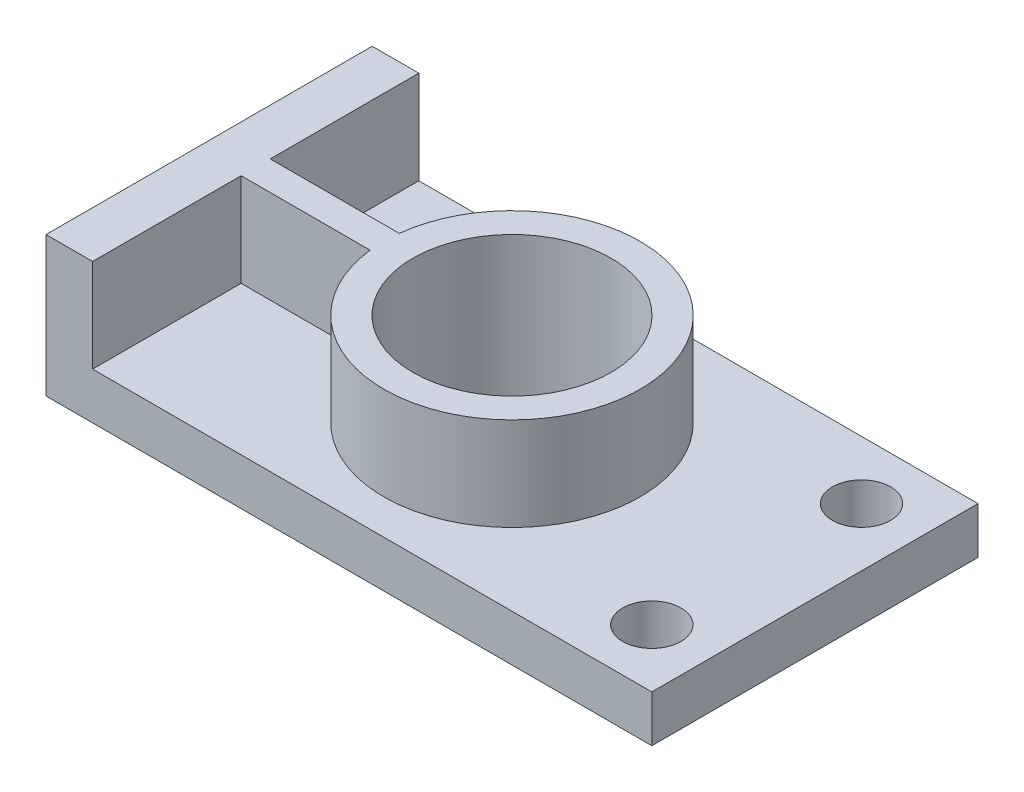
ISO-10303-21;
HEADER;
FILE_DESCRIPTION(('STEP AP214'),'2;1');
FILE_NAME('part.step','',(''),(''),'','','');
FILE_SCHEMA(('AUTOMOTIVE_DESIGN { 1 0 10303 214 1 1 1 1 }'));
ENDSEC;
DATA;
#1=APPLICATION_CONTEXT('core data for automotive mechanical design processes');
#2=APPLICATION_PROTOCOL_DEFINITION('international standard','automotive_design',2000,#1);
#3=PRODUCT_CONTEXT('',#1,'mechanical');
#4=PRODUCT('Part','Part','',(#3));
#5=PRODUCT_RELATED_PRODUCT_CATEGORY('part','',(#4));
#6=PRODUCT_DEFINITION_FORMATION('','',#4);
#7=PRODUCT_DEFINITION_CONTEXT('part definition',#1,'design');
#8=PRODUCT_DEFINITION('design','',#6,#7);
#9=PRODUCT_DEFINITION_SHAPE('','',#8);
#10=(LENGTH_UNIT() NAMED_UNIT(*) SI_UNIT(.MILLI.,.METRE.));
#11=(NAMED_UNIT(*) PLANE_ANGLE_UNIT() SI_UNIT($,.RADIAN.));
#12=(NAMED_UNIT(*) SI_UNIT($,.STERADIAN.) SOLID_ANGLE_UNIT());
#13=UNCERTAINTY_MEASURE_WITH_UNIT(LENGTH_MEASURE(1.E-05),#10,'distance_accuracy_value','');
#14=(GEOMETRIC_REPRESENTATION_CONTEXT(3) GLOBAL_UNCERTAINTY_ASSIGNED_CONTEXT((#13)) GLOBAL_UNIT_ASSIGNED_CONTEXT((#10,
#11,#12)) REPRESENTATION_CONTEXT('',''));
#15=CARTESIAN_POINT('',(0.,0.,0.));
#16=DIRECTION('',(0.,0.,1.));
#17=DIRECTION('',(1.,0.,0.));
#18=AXIS2_PLACEMENT_3D('',#15,#16,#17);
#19=CARTESIAN_POINT('',(12.7,38.1,-88.9));
#20=DIRECTION('',(-1.,0.,0.));
#21=DIRECTION('',(0.,-1.,0.));
#22=AXIS2_PLACEMENT_3D('',#19,#20,#21);
#23=PLANE('',#22);
#24=DIRECTION('',(0.,1.,0.));
#25=VECTOR('',#24,1.);
#26=CARTESIAN_POINT('',(12.7,38.1,-48.4187500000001));
#27=LINE('',#26,#25);
#28=CARTESIAN_POINT('',(12.7,12.7,-48.4187500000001));
#29=VERTEX_POINT('',#28);
#30=CARTESIAN_POINT('',(12.7,38.1,-48.4187500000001));
#31=VERTEX_POINT('',#30);
#32=EDGE_CURVE('E130',#29,#31,#27,.T.);
#33=ORIENTED_EDGE('',*,*,#32,.F.);
#34=DIRECTION('',(0.,0.,1.));
#35=VECTOR('',#34,1.);
#36=CARTESIAN_POINT('',(12.7,12.7,-88.9));
#37=LINE('',#36,#35);
#38=CARTESIAN_POINT('',(12.7,12.7,-88.9));
#39=VERTEX_POINT('',#38);
#40=EDGE_CURVE('E113',#39,#29,#37,.T.);
#41=ORIENTED_EDGE('',*,*,#40,.F.);
#42=DIRECTION('',(0.,-1.,0.));
#43=VECTOR('',#42,1.);
#44=CARTESIAN_POINT('',(12.7,38.1,-88.9));
#45=LINE('',#44,#43);
#46=CARTESIAN_POINT('',(12.7,38.1,-88.9));
#47=VERTEX_POINT('',#46);
#48=EDGE_CURVE('E181',#47,#39,#45,.T.);
#49=ORIENTED_EDGE('',*,*,#48,.F.);
#50=DIRECTION('',(0.,0.,1.));
#51=VECTOR('',#50,1.);
#52=CARTESIAN_POINT('',(12.7,38.1,-88.9));
#53=LINE('',#52,#51);
#54=EDGE_CURVE('E192',#47,#31,#53,.T.);
#55=ORIENTED_EDGE('',*,*,#54,.T.);
#56=EDGE_LOOP('',(#33,#41,#49,#55));
#57=FACE_BOUND('',#56,.T.);
#58=ADVANCED_FACE('F28',(#57),#23,.F.);
#59=CARTESIAN_POINT('',(0.,0.,-88.9));
#60=DIRECTION('',(0.,-1.,0.));
#61=DIRECTION('',(0.,0.,-1.));
#62=AXIS2_PLACEMENT_3D('',#59,#60,#61);
#63=PLANE('',#62);
#64=CARTESIAN_POINT('',(82.55,0.,-44.4500000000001));
#65=DIRECTION('',(0.,1.,0.));
#66=DIRECTION('',(0.,0.,1.));
#67=AXIS2_PLACEMENT_3D('',#64,#65,#66);
#68=CIRCLE('',#67,26.9875);
#69=CARTESIAN_POINT('',(82.55,0.,-17.4625000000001));
#70=VERTEX_POINT('',#69);
#71=EDGE_CURVE('E126',#70,#70,#68,.T.);
#72=ORIENTED_EDGE('',*,*,#71,.T.);
#73=EDGE_LOOP('',(#72));
#74=FACE_BOUND('',#73,.T.);
#75=DIRECTION('',(0.,0.,1.));
#76=VECTOR('',#75,1.);
#77=CARTESIAN_POINT('',(165.1,0.,-88.9));
#78=LINE('',#77,#76);
#79=CARTESIAN_POINT('',(165.1,0.,-88.9));
#80=VERTEX_POINT('',#79);
#81=CARTESIAN_POINT('',(165.1,0.,0.));
#82=VERTEX_POINT('',#81);
#83=EDGE_CURVE('E188',#80,#82,#78,.T.);
#84=ORIENTED_EDGE('',*,*,#83,.T.);
#85=DIRECTION('',(1.,0.,0.));
#86=VECTOR('',#85,1.);
#87=CARTESIAN_POINT('',(0.,0.,0.));
#88=LINE('',#87,#86);
#89=CARTESIAN_POINT('',(0.,0.,0.));
#90=VERTEX_POINT('',#89);
#91=EDGE_CURVE('E155',#90,#82,#88,.T.);
#92=ORIENTED_EDGE('',*,*,#91,.F.);
#93=DIRECTION('',(0.,0.,1.));
#94=VECTOR('',#93,1.);
#95=CARTESIAN_POINT('',(0.,0.,-88.9));
#96=LINE('',#95,#94);
#97=CARTESIAN_POINT('',(0.,0.,-88.9));
#98=VERTEX_POINT('',#97);
#99=EDGE_CURVE('E117',#98,#90,#96,.T.);
#100=ORIENTED_EDGE('',*,*,#99,.F.);
#101=DIRECTION('',(1.,0.,0.));
#102=VECTOR('',#101,1.);
#103=CARTESIAN_POINT('',(0.,0.,-88.9));
#104=LINE('',#103,#102);
#105=EDGE_CURVE('E174',#98,#80,#104,.T.);
#106=ORIENTED_EDGE('',*,*,#105,.T.);
#107=EDGE_LOOP('',(#84,#92,#100,#106));
#108=FACE_BOUND('',#107,.T.);
#109=CARTESIAN_POINT('',(149.225,0.,-73.025));
#110=DIRECTION('',(0.,1.,0.));
#111=DIRECTION('',(0.,0.,1.));
#112=AXIS2_PLACEMENT_3D('',#109,#110,#111);
#113=CIRCLE('',#112,7.93749999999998);
#114=CARTESIAN_POINT('',(149.225,0.,-65.0875));
#115=VERTEX_POINT('',#114);
#116=EDGE_CURVE('E141',#115,#115,#113,.T.);
#117=ORIENTED_EDGE('',*,*,#116,.T.);
#118=EDGE_LOOP('',(#117));
#119=FACE_BOUND('',#118,.T.);
#120=CARTESIAN_POINT('',(149.225,0.,-15.875));
#121=DIRECTION('',(0.,1.,0.));
#122=DIRECTION('',(0.,0.,1.));
#123=AXIS2_PLACEMENT_3D('',#120,#121,#122);
#124=CIRCLE('',#123,7.93749999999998);
#125=CARTESIAN_POINT('',(149.225,0.,-7.93750000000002));
#126=VERTEX_POINT('',#125);
#127=EDGE_CURVE('E147',#126,#126,#124,.T.);
#128=ORIENTED_EDGE('',*,*,#127,.T.);
#129=EDGE_LOOP('',(#128));
#130=FACE_BOUND('',#129,.T.);
#131=ADVANCED_FACE('F30',(#74,#108,#119,#130),#63,.T.);
#132=CARTESIAN_POINT('',(0.,38.1,-88.9));
#133=DIRECTION('',(-1.,0.,0.));
#134=DIRECTION('',(0.,-1.,0.));
#135=AXIS2_PLACEMENT_3D('',#132,#133,#134);
#136=PLANE('',#135);
#137=DIRECTION('',(0.,-1.,0.));
#138=VECTOR('',#137,1.);
#139=CARTESIAN_POINT('',(0.,38.1,0.));
#140=LINE('',#139,#138);
#141=CARTESIAN_POINT('',(0.,38.1,0.));
#142=VERTEX_POINT('',#141);
#143=EDGE_CURVE('E171',#142,#90,#140,.T.);
#144=ORIENTED_EDGE('',*,*,#143,.F.);
#145=DIRECTION('',(0.,0.,1.));
#146=VECTOR('',#145,1.);
#147=CARTESIAN_POINT('',(0.,38.1,-88.9));
#148=LINE('',#147,#146);
#149=CARTESIAN_POINT('',(0.,38.1,-88.9));
#150=VERTEX_POINT('',#149);
#151=EDGE_CURVE('E190',#150,#142,#148,.T.);
#152=ORIENTED_EDGE('',*,*,#151,.F.);
#153=DIRECTION('',(0.,-1.,0.));
#154=VECTOR('',#153,1.);
#155=CARTESIAN_POINT('',(0.,38.1,-88.9));
#156=LINE('',#155,#154);
#157=EDGE_CURVE('E185',#150,#98,#156,.T.);
#158=ORIENTED_EDGE('',*,*,#157,.T.);
#159=ORIENTED_EDGE('',*,*,#99,.T.);
#160=EDGE_LOOP('',(#144,#152,#158,#159));
#161=FACE_BOUND('',#160,.T.);
#162=ADVANCED_FACE('F216',(#161),#136,.T.);
#163=CARTESIAN_POINT('',(0.,38.1,-88.9));
#164=DIRECTION('',(0.,-1.,0.));
#165=DIRECTION('',(0.,0.,-1.));
#166=AXIS2_PLACEMENT_3D('',#163,#164,#165);
#167=PLANE('',#166);
#168=CARTESIAN_POINT('',(12.7,38.1,-40.4812500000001));
#169=VERTEX_POINT('',#168);
#170=CARTESIAN_POINT('',(12.7,38.1,0.));
#171=VERTEX_POINT('',#170);
#172=EDGE_CURVE('E194',#169,#171,#53,.T.);
#173=ORIENTED_EDGE('',*,*,#172,.F.);
#174=DIRECTION('',(1.,0.,0.));
#175=VECTOR('',#174,1.);
#176=CARTESIAN_POINT('',(42.7788467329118,38.1,-40.4812500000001));
#177=LINE('',#176,#175);
#178=CARTESIAN_POINT('',(47.8512298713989,38.1,-40.4812500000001));
#179=VERTEX_POINT('',#178);
#180=EDGE_CURVE('E43',#179,#169,#177,.F.);
#181=ORIENTED_EDGE('',*,*,#180,.F.);
#182=CARTESIAN_POINT('',(82.55,38.1,-44.4500000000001));
#183=DIRECTION('',(0.,1.,0.));
#184=DIRECTION('',(0.,0.,1.));
#185=AXIS2_PLACEMENT_3D('',#182,#183,#184);
#186=CIRCLE('',#185,34.925);
#187=CARTESIAN_POINT('',(47.8512298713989,38.1,-48.4187500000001));
#188=VERTEX_POINT('',#187);
#189=EDGE_CURVE('E125',#179,#188,#186,.T.);
#190=ORIENTED_EDGE('',*,*,#189,.T.);
#191=DIRECTION('',(1.,0.,0.));
#192=VECTOR('',#191,1.);
#193=CARTESIAN_POINT('',(42.7788467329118,38.1,-48.4187500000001));
#194=LINE('',#193,#192);
#195=EDGE_CURVE('E51',#188,#31,#194,.F.);
#196=ORIENTED_EDGE('',*,*,#195,.T.);
#197=ORIENTED_EDGE('',*,*,#54,.F.);
#198=DIRECTION('',(1.,0.,0.));
#199=VECTOR('',#198,1.);
#200=CARTESIAN_POINT('',(0.,38.1,-88.9));
#201=LINE('',#200,#199);
#202=EDGE_CURVE('E183',#150,#47,#201,.T.);
#203=ORIENTED_EDGE('',*,*,#202,.F.);
#204=ORIENTED_EDGE('',*,*,#151,.T.);
#205=DIRECTION('',(1.,0.,0.));
#206=VECTOR('',#205,1.);
#207=CARTESIAN_POINT('',(0.,38.1,0.));
#208=LINE('',#207,#206);
#209=EDGE_CURVE('E168',#142,#171,#208,.T.);
#210=ORIENTED_EDGE('',*,*,#209,.T.);
#211=EDGE_LOOP('',(#173,#181,#190,#196,#197,#203,#204,#210));
#212=FACE_BOUND('',#211,.T.);
#213=CARTESIAN_POINT('',(82.55,38.1,-44.4500000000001));
#214=DIRECTION('',(0.,1.,0.));
#215=DIRECTION('',(0.,0.,1.));
#216=AXIS2_PLACEMENT_3D('',#213,#214,#215);
#217=CIRCLE('',#216,26.9875);
#218=CARTESIAN_POINT('',(82.55,38.1,-17.4625000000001));
#219=VERTEX_POINT('',#218);
#220=EDGE_CURVE('E150',#219,#219,#217,.T.);
#221=ORIENTED_EDGE('',*,*,#220,.F.);
#222=EDGE_LOOP('',(#221));
#223=FACE_BOUND('',#222,.T.);
#224=ADVANCED_FACE('F226',(#212,#223),#167,.F.);
#225=CARTESIAN_POINT('',(12.7,12.7,-40.4812500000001));
#226=VERTEX_POINT('',#225);
#227=CARTESIAN_POINT('',(12.7,12.7,0.));
#228=VERTEX_POINT('',#227);
#229=EDGE_CURVE('E196',#226,#228,#37,.T.);
#230=ORIENTED_EDGE('',*,*,#229,.F.);
#231=DIRECTION('',(0.,1.,0.));
#232=VECTOR('',#231,1.);
#233=CARTESIAN_POINT('',(12.7,38.1,-40.4812500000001));
#234=LINE('',#233,#232);
#235=EDGE_CURVE('E136',#226,#169,#234,.T.);
#236=ORIENTED_EDGE('',*,*,#235,.T.);
#237=ORIENTED_EDGE('',*,*,#172,.T.);
#238=DIRECTION('',(0.,-1.,0.));
#239=VECTOR('',#238,1.);
#240=CARTESIAN_POINT('',(12.7,38.1,0.));
#241=LINE('',#240,#239);
#242=EDGE_CURVE('E165',#171,#228,#241,.T.);
#243=ORIENTED_EDGE('',*,*,#242,.T.);
#244=EDGE_LOOP('',(#230,#236,#237,#243));
#245=FACE_BOUND('',#244,.T.);
#246=ADVANCED_FACE('F224',(#245),#23,.F.);
#247=CARTESIAN_POINT('',(0.,12.7,-88.9));
#248=DIRECTION('',(0.,-1.,0.));
#249=DIRECTION('',(0.,0.,-1.));
#250=AXIS2_PLACEMENT_3D('',#247,#248,#249);
#251=PLANE('',#250);
#252=CARTESIAN_POINT('',(149.225,12.7,-73.025));
#253=DIRECTION('',(0.,1.,0.));
#254=DIRECTION('',(0.,0.,1.));
#255=AXIS2_PLACEMENT_3D('',#252,#253,#254);
#256=CIRCLE('',#255,7.93749999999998);
#257=CARTESIAN_POINT('',(149.225,12.7,-65.0875));
#258=VERTEX_POINT('',#257);
#259=EDGE_CURVE('E138',#258,#258,#256,.T.);
#260=ORIENTED_EDGE('',*,*,#259,.F.);
#261=EDGE_LOOP('',(#260));
#262=FACE_BOUND('',#261,.T.);
#263=DIRECTION('',(-1.,0.,0.));
#264=VECTOR('',#263,1.);
#265=CARTESIAN_POINT('',(0.,12.7,-48.4187500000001));
#266=LINE('',#265,#264);
#267=CARTESIAN_POINT('',(47.8512298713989,12.7,-48.4187500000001));
#268=VERTEX_POINT('',#267);
#269=EDGE_CURVE('E32',#268,#29,#266,.T.);
#270=ORIENTED_EDGE('',*,*,#269,.F.);
#271=CARTESIAN_POINT('',(82.55,12.7,-44.4500000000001));
#272=DIRECTION('',(0.,-1.,0.));
#273=DIRECTION('',(0.,0.,-1.));
#274=AXIS2_PLACEMENT_3D('',#271,#272,#273);
#275=CIRCLE('',#274,34.925);
#276=CARTESIAN_POINT('',(47.8512298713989,12.7,-40.4812500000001));
#277=VERTEX_POINT('',#276);
#278=EDGE_CURVE('E110',#277,#268,#275,.F.);
#279=ORIENTED_EDGE('',*,*,#278,.F.);
#280=DIRECTION('',(-1.,0.,0.));
#281=VECTOR('',#280,1.);
#282=CARTESIAN_POINT('',(0.,12.7,-40.4812500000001));
#283=LINE('',#282,#281);
#284=EDGE_CURVE('E11',#277,#226,#283,.T.);
#285=ORIENTED_EDGE('',*,*,#284,.T.);
#286=ORIENTED_EDGE('',*,*,#229,.T.);
#287=DIRECTION('',(1.,0.,0.));
#288=VECTOR('',#287,1.);
#289=CARTESIAN_POINT('',(0.,12.7,0.));
#290=LINE('',#289,#288);
#291=CARTESIAN_POINT('',(165.1,12.7,0.));
#292=VERTEX_POINT('',#291);
#293=EDGE_CURVE('E162',#228,#292,#290,.T.);
#294=ORIENTED_EDGE('',*,*,#293,.T.);
#295=DIRECTION('',(0.,0.,1.));
#296=VECTOR('',#295,1.);
#297=CARTESIAN_POINT('',(165.1,12.7,-88.9));
#298=LINE('',#297,#296);
#299=CARTESIAN_POINT('',(165.1,12.7,-88.9));
#300=VERTEX_POINT('',#299);
#301=EDGE_CURVE('E197',#300,#292,#298,.T.);
#302=ORIENTED_EDGE('',*,*,#301,.F.);
#303=DIRECTION('',(1.,0.,0.));
#304=VECTOR('',#303,1.);
#305=CARTESIAN_POINT('',(0.,12.7,-88.9));
#306=LINE('',#305,#304);
#307=EDGE_CURVE('E179',#39,#300,#306,.T.);
#308=ORIENTED_EDGE('',*,*,#307,.F.);
#309=ORIENTED_EDGE('',*,*,#40,.T.);
#310=EDGE_LOOP('',(#270,#279,#285,#286,#294,#302,#308,#309));
#311=FACE_BOUND('',#310,.T.);
#312=CARTESIAN_POINT('',(149.225,12.7,-15.875));
#313=DIRECTION('',(0.,1.,0.));
#314=DIRECTION('',(0.,0.,1.));
#315=AXIS2_PLACEMENT_3D('',#312,#313,#314);
#316=CIRCLE('',#315,7.93749999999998);
#317=CARTESIAN_POINT('',(149.225,12.7,-7.93750000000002));
#318=VERTEX_POINT('',#317);
#319=EDGE_CURVE('E144',#318,#318,#316,.T.);
#320=ORIENTED_EDGE('',*,*,#319,.F.);
#321=EDGE_LOOP('',(#320));
#322=FACE_BOUND('',#321,.T.);
#323=ADVANCED_FACE('F108',(#262,#311,#322),#251,.F.);
#324=CARTESIAN_POINT('',(165.1,12.7,-88.9));
#325=DIRECTION('',(-1.,0.,0.));
#326=DIRECTION('',(0.,0.,1.));
#327=AXIS2_PLACEMENT_3D('',#324,#325,#326);
#328=PLANE('',#327);
#329=ORIENTED_EDGE('',*,*,#301,.T.);
#330=DIRECTION('',(0.,-1.,0.));
#331=VECTOR('',#330,1.);
#332=CARTESIAN_POINT('',(165.1,12.7,0.));
#333=LINE('',#332,#331);
#334=EDGE_CURVE('E159',#292,#82,#333,.T.);
#335=ORIENTED_EDGE('',*,*,#334,.T.);
#336=ORIENTED_EDGE('',*,*,#83,.F.);
#337=DIRECTION('',(0.,-1.,0.));
#338=VECTOR('',#337,1.);
#339=CARTESIAN_POINT('',(165.1,12.7,-88.9));
#340=LINE('',#339,#338);
#341=EDGE_CURVE('E177',#300,#80,#340,.T.);
#342=ORIENTED_EDGE('',*,*,#341,.F.);
#343=EDGE_LOOP('',(#329,#335,#336,#342));
#344=FACE_BOUND('',#343,.T.);
#345=ADVANCED_FACE('F207',(#344),#328,.F.);
#346=CARTESIAN_POINT('',(165.1,0.,-88.9));
#347=DIRECTION('',(0.,0.,-1.));
#348=DIRECTION('',(-1.,0.,0.));
#349=AXIS2_PLACEMENT_3D('',#346,#347,#348);
#350=PLANE('',#349);
#351=ORIENTED_EDGE('',*,*,#105,.F.);
#352=ORIENTED_EDGE('',*,*,#157,.F.);
#353=ORIENTED_EDGE('',*,*,#202,.T.);
#354=ORIENTED_EDGE('',*,*,#48,.T.);
#355=ORIENTED_EDGE('',*,*,#307,.T.);
#356=ORIENTED_EDGE('',*,*,#341,.T.);
#357=EDGE_LOOP('',(#351,#352,#353,#354,#355,#356));
#358=FACE_BOUND('',#357,.T.);
#359=ADVANCED_FACE('F220',(#358),#350,.T.);
#360=CARTESIAN_POINT('',(165.1,0.,0.));
#361=DIRECTION('',(0.,0.,-1.));
#362=DIRECTION('',(-1.,0.,0.));
#363=AXIS2_PLACEMENT_3D('',#360,#361,#362);
#364=PLANE('',#363);
#365=ORIENTED_EDGE('',*,*,#91,.T.);
#366=ORIENTED_EDGE('',*,*,#334,.F.);
#367=ORIENTED_EDGE('',*,*,#293,.F.);
#368=ORIENTED_EDGE('',*,*,#242,.F.);
#369=ORIENTED_EDGE('',*,*,#209,.F.);
#370=ORIENTED_EDGE('',*,*,#143,.T.);
#371=EDGE_LOOP('',(#365,#366,#367,#368,#369,#370));
#372=FACE_BOUND('',#371,.T.);
#373=ADVANCED_FACE('F211',(#372),#364,.F.);
#374=CARTESIAN_POINT('',(82.55,-0.001000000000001,-44.4500000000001));
#375=DIRECTION('',(0.,1.,0.));
#376=DIRECTION('',(0.,0.,1.));
#377=AXIS2_PLACEMENT_3D('',#374,#375,#376);
#378=CYLINDRICAL_SURFACE('',#377,34.925);
#379=DIRECTION('',(0.,1.,0.));
#380=VECTOR('',#379,1.);
#381=CARTESIAN_POINT('',(47.8512298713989,-0.001000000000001,-48.4187500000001));
#382=LINE('',#381,#380);
#383=EDGE_CURVE('E123',#188,#268,#382,.F.);
#384=ORIENTED_EDGE('',*,*,#383,.F.);
#385=ORIENTED_EDGE('',*,*,#189,.F.);
#386=DIRECTION('',(0.,1.,0.));
#387=VECTOR('',#386,1.);
#388=CARTESIAN_POINT('',(47.8512298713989,-0.001000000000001,-40.4812500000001));
#389=LINE('',#388,#387);
#390=EDGE_CURVE('E124',#179,#277,#389,.F.);
#391=ORIENTED_EDGE('',*,*,#390,.T.);
#392=ORIENTED_EDGE('',*,*,#278,.T.);
#393=EDGE_LOOP('',(#384,#385,#391,#392));
#394=FACE_BOUND('',#393,.T.);
#395=ADVANCED_FACE('F121',(#394),#378,.T.);
#396=CARTESIAN_POINT('',(82.55,0.,-44.4500000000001));
#397=DIRECTION('',(0.,1.,0.));
#398=DIRECTION('',(0.,0.,1.));
#399=AXIS2_PLACEMENT_3D('',#396,#397,#398);
#400=CYLINDRICAL_SURFACE('',#399,26.9875);
#401=CARTESIAN_POINT('',(82.55,0.,-17.4625000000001));
#402=CARTESIAN_POINT('',(82.55,0.396875,-17.4625000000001));
#403=CARTESIAN_POINT('',(82.55,0.79375,-17.4625000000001));
#404=CARTESIAN_POINT('',(82.55,1.5875,-17.4625000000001));
#405=CARTESIAN_POINT('',(82.55,1.984375,-17.4625000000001));
#406=CARTESIAN_POINT('',(82.55,2.778125,-17.4625000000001));
#407=CARTESIAN_POINT('',(82.55,3.175,-17.4625000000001));
#408=CARTESIAN_POINT('',(82.55,3.96875,-17.4625000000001));
#409=CARTESIAN_POINT('',(82.55,4.365625,-17.4625000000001));
#410=CARTESIAN_POINT('',(82.55,5.159375,-17.4625000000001));
#411=CARTESIAN_POINT('',(82.55,5.55625,-17.4625000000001));
#412=CARTESIAN_POINT('',(82.55,6.35,-17.4625000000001));
#413=CARTESIAN_POINT('',(82.55,6.746875,-17.4625000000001));
#414=CARTESIAN_POINT('',(82.55,7.540625,-17.4625000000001));
#415=CARTESIAN_POINT('',(82.55,7.9375,-17.4625000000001));
#416=CARTESIAN_POINT('',(82.55,8.73125,-17.4625000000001));
#417=CARTESIAN_POINT('',(82.55,9.128125,-17.4625000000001));
#418=CARTESIAN_POINT('',(82.55,9.921875,-17.4625000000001));
#419=CARTESIAN_POINT('',(82.55,10.31875,-17.4625000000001));
#420=CARTESIAN_POINT('',(82.55,11.1125,-17.4625000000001));
#421=CARTESIAN_POINT('',(82.55,11.509375,-17.4625000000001));
#422=CARTESIAN_POINT('',(82.55,12.303125,-17.4625000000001));
#423=CARTESIAN_POINT('',(82.55,12.7,-17.4625000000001));
#424=CARTESIAN_POINT('',(82.55,13.49375,-17.4625000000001));
#425=CARTESIAN_POINT('',(82.55,13.890625,-17.4625000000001));
#426=CARTESIAN_POINT('',(82.55,14.684375,-17.4625000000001));
#427=CARTESIAN_POINT('',(82.55,15.08125,-17.4625000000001));
#428=CARTESIAN_POINT('',(82.55,15.875,-17.4625000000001));
#429=CARTESIAN_POINT('',(82.55,16.271875,-17.4625000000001));
#430=CARTESIAN_POINT('',(82.55,17.065625,-17.4625000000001));
#431=CARTESIAN_POINT('',(82.55,17.4625,-17.4625000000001));
#432=CARTESIAN_POINT('',(82.55,18.25625,-17.4625000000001));
#433=CARTESIAN_POINT('',(82.55,18.653125,-17.4625000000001));
#434=CARTESIAN_POINT('',(82.55,19.446875,-17.4625000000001));
#435=CARTESIAN_POINT('',(82.55,19.84375,-17.4625000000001));
#436=CARTESIAN_POINT('',(82.55,20.6375,-17.4625000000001));
#437=CARTESIAN_POINT('',(82.55,21.034375,-17.4625000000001));
#438=CARTESIAN_POINT('',(82.55,21.828125,-17.4625000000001));
#439=CARTESIAN_POINT('',(82.55,22.225,-17.4625000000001));
#440=CARTESIAN_POINT('',(82.55,23.01875,-17.4625000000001));
#441=CARTESIAN_POINT('',(82.55,23.415625,-17.4625000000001));
#442=CARTESIAN_POINT('',(82.55,24.209375,-17.4625000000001));
#443=CARTESIAN_POINT('',(82.55,24.60625,-17.4625000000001));
#444=CARTESIAN_POINT('',(82.55,25.4,-17.4625000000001));
#445=CARTESIAN_POINT('',(82.55,25.796875,-17.4625000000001));
#446=CARTESIAN_POINT('',(82.55,26.590625,-17.4625000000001));
#447=CARTESIAN_POINT('',(82.55,26.9875,-17.4625000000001));
#448=CARTESIAN_POINT('',(82.55,27.78125,-17.4625000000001));
#449=CARTESIAN_POINT('',(82.55,28.178125,-17.4625000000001));
#450=CARTESIAN_POINT('',(82.55,28.971875,-17.4625000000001));
#451=CARTESIAN_POINT('',(82.55,29.36875,-17.4625000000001));
#452=CARTESIAN_POINT('',(82.55,30.1625,-17.4625000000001));
#453=CARTESIAN_POINT('',(82.55,30.559375,-17.4625000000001));
#454=CARTESIAN_POINT('',(82.55,31.353125,-17.4625000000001));
#455=CARTESIAN_POINT('',(82.55,31.75,-17.4625000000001));
#456=CARTESIAN_POINT('',(82.55,32.54375,-17.4625000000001));
#457=CARTESIAN_POINT('',(82.55,32.940625,-17.4625000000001));
#458=CARTESIAN_POINT('',(82.55,33.734375,-17.4625000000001));
#459=CARTESIAN_POINT('',(82.55,34.13125,-17.4625000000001));
#460=CARTESIAN_POINT('',(82.55,34.925,-17.4625000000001));
#461=CARTESIAN_POINT('',(82.55,35.321875,-17.4625000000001));
#462=CARTESIAN_POINT('',(82.55,36.115625,-17.4625000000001));
#463=CARTESIAN_POINT('',(82.55,36.5125,-17.4625000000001));
#464=CARTESIAN_POINT('',(82.55,37.30625,-17.4625000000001));
#465=CARTESIAN_POINT('',(82.55,37.703125,-17.4625000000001));
#466=CARTESIAN_POINT('',(82.55,38.1,-17.4625000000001));
#467=B_SPLINE_CURVE_WITH_KNOTS('',3,(#401,#402,#403,#404,#405,#406,#407,#408,#409,#410,#411,
#412,#413,#414,#415,#416,#417,#418,#419,#420,#421,#422,#423,#424,#425,#426,#427,#428,#429,#430,
#431,#432,#433,#434,#435,#436,#437,#438,#439,#440,#441,#442,#443,#444,#445,#446,#447,#448,#449,
#450,#451,#452,#453,#454,#455,#456,#457,#458,#459,#460,#461,#462,#463,#464,#465,#466),
.UNSPECIFIED.,.F.,.F.,(4,2,2,2,2,2,2,2,2,2,2,2,2,2,2,2,2,2,2,2,2,2,2,2,2,2,2,2,2,2,2,2,4),(0.,
1.190625,2.38125,3.571875,4.7625,5.953125,7.14375,8.334375,9.525,10.715625,11.90625,13.096875,
14.2875,15.478125,16.66875,17.859375,19.05,20.240625,21.43125,22.621875,23.8125,25.003125,
26.19375,27.384375,28.575,29.765625,30.95625,32.146875,33.3375,34.528125,35.71875,36.909375,
38.1),.UNSPECIFIED.);
#468=EDGE_CURVE('BSEAM255',#70,#219,#467,.T.);
#469=ORIENTED_EDGE('',*,*,#71,.F.);
#470=ORIENTED_EDGE('',*,*,#220,.T.);
#471=ORIENTED_EDGE('',*,*,#468,.T.);
#472=ORIENTED_EDGE('',*,*,#468,.F.);
#473=EDGE_LOOP('',(#469,#471,#470,#472));
#474=FACE_BOUND('',#473,.T.);
#475=ADVANCED_FACE('F255',(#474),#400,.F.);
#476=CARTESIAN_POINT('',(149.225,0.,-15.875));
#477=DIRECTION('',(0.,1.,0.));
#478=DIRECTION('',(0.,0.,1.));
#479=AXIS2_PLACEMENT_3D('',#476,#477,#478);
#480=CYLINDRICAL_SURFACE('',#479,7.93749999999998);
#481=ORIENTED_EDGE('',*,*,#127,.F.);
#482=EDGE_LOOP('',(#481));
#483=FACE_BOUND('',#482,.T.);
#484=ORIENTED_EDGE('',*,*,#319,.T.);
#485=EDGE_LOOP('',(#484));
#486=FACE_BOUND('',#485,.T.);
#487=ADVANCED_FACE('F258',(#483,#486),#480,.F.);
#488=CARTESIAN_POINT('',(149.225,0.,-73.025));
#489=DIRECTION('',(0.,1.,0.));
#490=DIRECTION('',(0.,0.,1.));
#491=AXIS2_PLACEMENT_3D('',#488,#489,#490);
#492=CYLINDRICAL_SURFACE('',#491,7.93749999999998);
#493=ORIENTED_EDGE('',*,*,#116,.F.);
#494=EDGE_LOOP('',(#493));
#495=FACE_BOUND('',#494,.T.);
#496=ORIENTED_EDGE('',*,*,#259,.T.);
#497=EDGE_LOOP('',(#496));
#498=FACE_BOUND('',#497,.T.);
#499=ADVANCED_FACE('F262',(#495,#498),#492,.F.);
#500=CARTESIAN_POINT('',(42.7788467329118,38.1,-40.4812500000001));
#501=DIRECTION('',(0.,0.,1.));
#502=DIRECTION('',(1.,0.,0.));
#503=AXIS2_PLACEMENT_3D('',#500,#501,#502);
#504=PLANE('',#503);
#505=ORIENTED_EDGE('',*,*,#284,.F.);
#506=ORIENTED_EDGE('',*,*,#390,.F.);
#507=ORIENTED_EDGE('',*,*,#180,.T.);
#508=ORIENTED_EDGE('',*,*,#235,.F.);
#509=EDGE_LOOP('',(#505,#506,#507,#508));
#510=FACE_BOUND('',#509,.T.);
#511=ADVANCED_FACE('F265',(#510),#504,.T.);
#512=CARTESIAN_POINT('',(42.7788467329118,38.1,-48.4187500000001));
#513=DIRECTION('',(0.,0.,1.));
#514=DIRECTION('',(1.,0.,0.));
#515=AXIS2_PLACEMENT_3D('',#512,#513,#514);
#516=PLANE('',#515);
#517=ORIENTED_EDGE('',*,*,#195,.F.);
#518=ORIENTED_EDGE('',*,*,#383,.T.);
#519=ORIENTED_EDGE('',*,*,#269,.T.);
#520=ORIENTED_EDGE('',*,*,#32,.T.);
#521=EDGE_LOOP('',(#517,#518,#519,#520));
#522=FACE_BOUND('',#521,.T.);
#523=ADVANCED_FACE('F128',(#522),#516,.F.);
#524=CLOSED_SHELL('',(#58,#131,#162,#224,#246,#323,#345,#359,#373,#395,#475,#487,#499,#511,#523));
#525=MANIFOLD_SOLID_BREP('B2',#524);
#526=ADVANCED_BREP_SHAPE_REPRESENTATION('',(#18,#525),#14);
#527=SHAPE_DEFINITION_REPRESENTATION(#9,#526);
ENDSEC;
END-ISO-10303-21;
